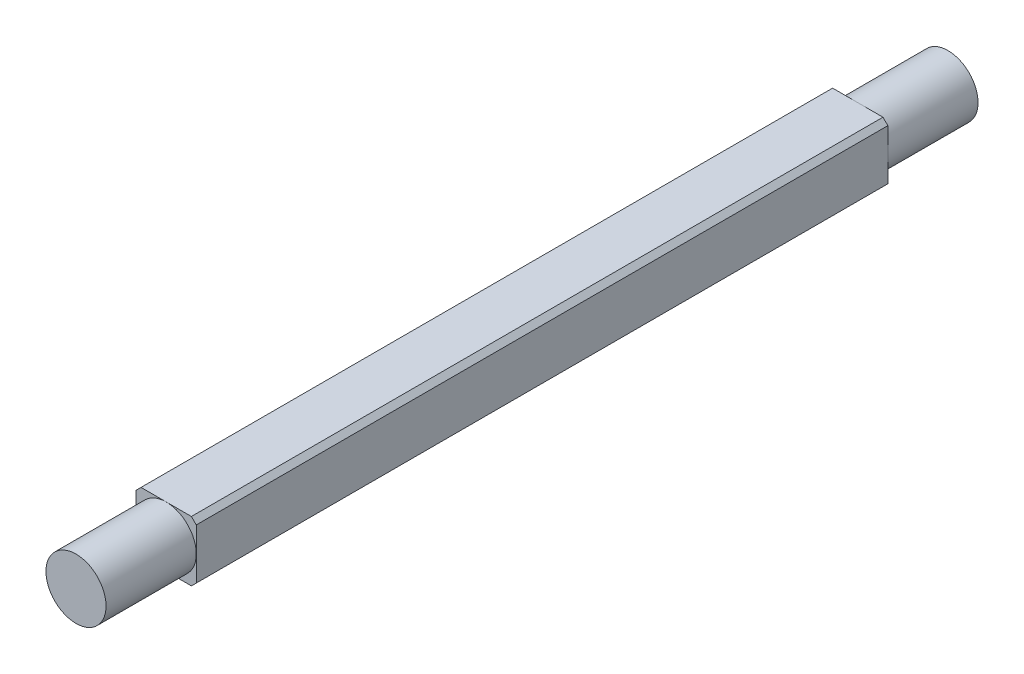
ISO-10303-21;
HEADER;
FILE_DESCRIPTION(('STEP AP214'),'2;1');
FILE_NAME('part.step','',(''),(''),'','','');
FILE_SCHEMA(('AUTOMOTIVE_DESIGN { 1 0 10303 214 1 1 1 1 }'));
ENDSEC;
DATA;
#1=APPLICATION_CONTEXT('core data for automotive mechanical design processes');
#2=APPLICATION_PROTOCOL_DEFINITION('international standard','automotive_design',2000,#1);
#3=PRODUCT_CONTEXT('',#1,'mechanical');
#4=PRODUCT('Part','Part','',(#3));
#5=PRODUCT_RELATED_PRODUCT_CATEGORY('part','',(#4));
#6=PRODUCT_DEFINITION_FORMATION('','',#4);
#7=PRODUCT_DEFINITION_CONTEXT('part definition',#1,'design');
#8=PRODUCT_DEFINITION('design','',#6,#7);
#9=PRODUCT_DEFINITION_SHAPE('','',#8);
#10=(LENGTH_UNIT() NAMED_UNIT(*) SI_UNIT(.MILLI.,.METRE.));
#11=(NAMED_UNIT(*) PLANE_ANGLE_UNIT() SI_UNIT($,.RADIAN.));
#12=(NAMED_UNIT(*) SI_UNIT($,.STERADIAN.) SOLID_ANGLE_UNIT());
#13=UNCERTAINTY_MEASURE_WITH_UNIT(LENGTH_MEASURE(1.E-05),#10,'distance_accuracy_value','');
#14=(GEOMETRIC_REPRESENTATION_CONTEXT(3) GLOBAL_UNCERTAINTY_ASSIGNED_CONTEXT((#13)) GLOBAL_UNIT_ASSIGNED_CONTEXT((#10,
#11,#12)) REPRESENTATION_CONTEXT('',''));
#15=CARTESIAN_POINT('',(0.,0.,0.));
#16=DIRECTION('',(0.,0.,1.));
#17=DIRECTION('',(1.,0.,0.));
#18=AXIS2_PLACEMENT_3D('',#15,#16,#17);
#19=CARTESIAN_POINT('',(0.,0.,0.));
#20=DIRECTION('',(0.,0.,1.));
#21=DIRECTION('',(1.,0.,0.));
#22=AXIS2_PLACEMENT_3D('',#19,#20,#21);
#23=PLANE('',#22);
#24=CARTESIAN_POINT('',(0.,0.,0.));
#25=DIRECTION('',(0.,0.,-1.));
#26=DIRECTION('',(-1.,0.,0.));
#27=AXIS2_PLACEMENT_3D('',#24,#25,#26);
#28=CIRCLE('',#27,4.);
#29=CARTESIAN_POINT('',(-4.,0.,0.));
#30=VERTEX_POINT('',#29);
#31=CARTESIAN_POINT('',(0.,4.,0.));
#32=VERTEX_POINT('',#31);
#33=EDGE_CURVE('E54',#30,#32,#28,.T.);
#34=ORIENTED_EDGE('',*,*,#33,.F.);
#35=DIRECTION('',(0.,-1.,0.));
#36=VECTOR('',#35,1.);
#37=CARTESIAN_POINT('',(-4.,4.,0.));
#38=LINE('',#37,#36);
#39=CARTESIAN_POINT('',(-4.,3.34999999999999,0.));
#40=VERTEX_POINT('',#39);
#41=EDGE_CURVE('E125',#40,#30,#38,.T.);
#42=ORIENTED_EDGE('',*,*,#41,.F.);
#43=DIRECTION('',(-0.707106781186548,-0.707106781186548,0.));
#44=VECTOR('',#43,1.);
#45=CARTESIAN_POINT('',(-4.,3.34999999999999,0.));
#46=LINE('',#45,#44);
#47=CARTESIAN_POINT('',(-3.34999999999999,4.,0.));
#48=VERTEX_POINT('',#47);
#49=EDGE_CURVE('E197',#40,#48,#46,.F.);
#50=ORIENTED_EDGE('',*,*,#49,.T.);
#51=DIRECTION('',(-1.,0.,0.));
#52=VECTOR('',#51,1.);
#53=CARTESIAN_POINT('',(-4.,4.,0.));
#54=LINE('',#53,#52);
#55=EDGE_CURVE('E145',#32,#48,#54,.T.);
#56=ORIENTED_EDGE('',*,*,#55,.F.);
#57=EDGE_LOOP('',(#34,#42,#50,#56));
#58=FACE_BOUND('',#57,.T.);
#59=ADVANCED_FACE('F41',(#58),#23,.F.);
#60=CARTESIAN_POINT('',(4.,0.,0.));
#61=VERTEX_POINT('',#60);
#62=EDGE_CURVE('E11',#32,#61,#28,.T.);
#63=ORIENTED_EDGE('',*,*,#62,.F.);
#64=CARTESIAN_POINT('',(3.35,4.,0.));
#65=VERTEX_POINT('',#64);
#66=EDGE_CURVE('E142',#65,#32,#54,.T.);
#67=ORIENTED_EDGE('',*,*,#66,.F.);
#68=DIRECTION('',(-0.707106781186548,0.707106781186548,0.));
#69=VECTOR('',#68,1.);
#70=CARTESIAN_POINT('',(3.35,4.,0.));
#71=LINE('',#70,#69);
#72=CARTESIAN_POINT('',(4.,3.35,0.));
#73=VERTEX_POINT('',#72);
#74=EDGE_CURVE('E206',#65,#73,#71,.F.);
#75=ORIENTED_EDGE('',*,*,#74,.T.);
#76=DIRECTION('',(0.,1.,0.));
#77=VECTOR('',#76,1.);
#78=CARTESIAN_POINT('',(4.,4.,0.));
#79=LINE('',#78,#77);
#80=EDGE_CURVE('E162',#61,#73,#79,.T.);
#81=ORIENTED_EDGE('',*,*,#80,.F.);
#82=EDGE_LOOP('',(#63,#67,#75,#81));
#83=FACE_BOUND('',#82,.T.);
#84=ADVANCED_FACE('F277',(#83),#23,.F.);
#85=CARTESIAN_POINT('',(0.,-4.,0.));
#86=VERTEX_POINT('',#85);
#87=EDGE_CURVE('E52',#61,#86,#28,.T.);
#88=ORIENTED_EDGE('',*,*,#87,.F.);
#89=CARTESIAN_POINT('',(4.,-3.35,0.));
#90=VERTEX_POINT('',#89);
#91=EDGE_CURVE('E182',#90,#61,#79,.T.);
#92=ORIENTED_EDGE('',*,*,#91,.F.);
#93=DIRECTION('',(0.707106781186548,0.707106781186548,0.));
#94=VECTOR('',#93,1.);
#95=CARTESIAN_POINT('',(4.,-3.35,0.));
#96=LINE('',#95,#94);
#97=CARTESIAN_POINT('',(3.35,-4.,0.));
#98=VERTEX_POINT('',#97);
#99=EDGE_CURVE('E202',#90,#98,#96,.F.);
#100=ORIENTED_EDGE('',*,*,#99,.T.);
#101=DIRECTION('',(1.,0.,0.));
#102=VECTOR('',#101,1.);
#103=CARTESIAN_POINT('',(-4.,-4.,0.));
#104=LINE('',#103,#102);
#105=EDGE_CURVE('E136',#86,#98,#104,.T.);
#106=ORIENTED_EDGE('',*,*,#105,.F.);
#107=EDGE_LOOP('',(#88,#92,#100,#106));
#108=FACE_BOUND('',#107,.T.);
#109=ADVANCED_FACE('F255',(#108),#23,.F.);
#110=CARTESIAN_POINT('',(4.,4.,92.));
#111=DIRECTION('',(-1.,0.,0.));
#112=DIRECTION('',(0.,-1.,0.));
#113=AXIS2_PLACEMENT_3D('',#110,#111,#112);
#114=PLANE('',#113);
#115=ORIENTED_EDGE('',*,*,#91,.T.);
#116=ORIENTED_EDGE('',*,*,#80,.T.);
#117=DIRECTION('',(0.,0.,1.));
#118=VECTOR('',#117,1.);
#119=CARTESIAN_POINT('',(4.,3.35,92.));
#120=LINE('',#119,#118);
#121=CARTESIAN_POINT('',(4.,3.35,92.));
#122=VERTEX_POINT('',#121);
#123=EDGE_CURVE('E214',#73,#122,#120,.T.);
#124=ORIENTED_EDGE('',*,*,#123,.T.);
#125=DIRECTION('',(0.,1.,0.));
#126=VECTOR('',#125,1.);
#127=CARTESIAN_POINT('',(4.,4.,92.));
#128=LINE('',#127,#126);
#129=CARTESIAN_POINT('',(4.,-3.35,92.));
#130=VERTEX_POINT('',#129);
#131=EDGE_CURVE('E164',#130,#122,#128,.T.);
#132=ORIENTED_EDGE('',*,*,#131,.F.);
#133=DIRECTION('',(0.,0.,-1.));
#134=VECTOR('',#133,1.);
#135=CARTESIAN_POINT('',(4.,-3.35,92.));
#136=LINE('',#135,#134);
#137=EDGE_CURVE('E210',#130,#90,#136,.T.);
#138=ORIENTED_EDGE('',*,*,#137,.T.);
#139=EDGE_LOOP('',(#115,#116,#124,#132,#138));
#140=FACE_BOUND('',#139,.T.);
#141=ADVANCED_FACE('F254',(#140),#114,.F.);
#142=CARTESIAN_POINT('',(-4.,4.,92.));
#143=DIRECTION('',(0.,-1.,0.));
#144=DIRECTION('',(0.,0.,-1.));
#145=AXIS2_PLACEMENT_3D('',#142,#143,#144);
#146=PLANE('',#145);
#147=DIRECTION('',(-1.,0.,0.));
#148=VECTOR('',#147,1.);
#149=CARTESIAN_POINT('',(-4.,4.,92.));
#150=LINE('',#149,#148);
#151=CARTESIAN_POINT('',(3.35,4.,92.));
#152=VERTEX_POINT('',#151);
#153=CARTESIAN_POINT('',(-3.34999999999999,4.,92.));
#154=VERTEX_POINT('',#153);
#155=EDGE_CURVE('E168',#152,#154,#150,.T.);
#156=ORIENTED_EDGE('',*,*,#155,.F.);
#157=DIRECTION('',(0.,0.,-1.));
#158=VECTOR('',#157,1.);
#159=CARTESIAN_POINT('',(3.35,4.,92.));
#160=LINE('',#159,#158);
#161=EDGE_CURVE('E193',#152,#65,#160,.T.);
#162=ORIENTED_EDGE('',*,*,#161,.T.);
#163=ORIENTED_EDGE('',*,*,#66,.T.);
#164=ORIENTED_EDGE('',*,*,#55,.T.);
#165=DIRECTION('',(0.,0.,1.));
#166=VECTOR('',#165,1.);
#167=CARTESIAN_POINT('',(-3.34999999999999,4.,92.));
#168=LINE('',#167,#166);
#169=EDGE_CURVE('E181',#48,#154,#168,.T.);
#170=ORIENTED_EDGE('',*,*,#169,.T.);
#171=EDGE_LOOP('',(#156,#162,#163,#164,#170));
#172=FACE_BOUND('',#171,.T.);
#173=ADVANCED_FACE('F298',(#172),#146,.F.);
#174=CARTESIAN_POINT('',(-4.,4.,92.));
#175=DIRECTION('',(1.,0.,0.));
#176=DIRECTION('',(0.,1.,0.));
#177=AXIS2_PLACEMENT_3D('',#174,#175,#176);
#178=PLANE('',#177);
#179=ORIENTED_EDGE('',*,*,#41,.T.);
#180=CARTESIAN_POINT('',(-4.,-3.35,0.));
#181=VERTEX_POINT('',#180);
#182=EDGE_CURVE('E127',#30,#181,#38,.T.);
#183=ORIENTED_EDGE('',*,*,#182,.T.);
#184=DIRECTION('',(0.,0.,1.));
#185=VECTOR('',#184,1.);
#186=CARTESIAN_POINT('',(-4.,-3.35,92.));
#187=LINE('',#186,#185);
#188=CARTESIAN_POINT('',(-4.,-3.35,92.));
#189=VERTEX_POINT('',#188);
#190=EDGE_CURVE('E46',#181,#189,#187,.T.);
#191=ORIENTED_EDGE('',*,*,#190,.T.);
#192=DIRECTION('',(0.,-1.,0.));
#193=VECTOR('',#192,1.);
#194=CARTESIAN_POINT('',(-4.,4.,92.));
#195=LINE('',#194,#193);
#196=CARTESIAN_POINT('',(-4.,3.34999999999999,92.));
#197=VERTEX_POINT('',#196);
#198=EDGE_CURVE('E173',#197,#189,#195,.T.);
#199=ORIENTED_EDGE('',*,*,#198,.F.);
#200=DIRECTION('',(0.,0.,-1.));
#201=VECTOR('',#200,1.);
#202=CARTESIAN_POINT('',(-4.,3.34999999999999,92.));
#203=LINE('',#202,#201);
#204=EDGE_CURVE('E131',#197,#40,#203,.T.);
#205=ORIENTED_EDGE('',*,*,#204,.T.);
#206=EDGE_LOOP('',(#179,#183,#191,#199,#205));
#207=FACE_BOUND('',#206,.T.);
#208=ADVANCED_FACE('F126',(#207),#178,.F.);
#209=CARTESIAN_POINT('',(-4.,-4.,92.));
#210=DIRECTION('',(0.,1.,0.));
#211=DIRECTION('',(0.,0.,1.));
#212=AXIS2_PLACEMENT_3D('',#209,#210,#211);
#213=PLANE('',#212);
#214=CARTESIAN_POINT('',(-3.35,-4.,0.));
#215=VERTEX_POINT('',#214);
#216=EDGE_CURVE('E169',#215,#86,#104,.T.);
#217=ORIENTED_EDGE('',*,*,#216,.T.);
#218=ORIENTED_EDGE('',*,*,#105,.T.);
#219=DIRECTION('',(0.,0.,1.));
#220=VECTOR('',#219,1.);
#221=CARTESIAN_POINT('',(3.35,-4.,92.));
#222=LINE('',#221,#220);
#223=CARTESIAN_POINT('',(3.35,-4.,92.));
#224=VERTEX_POINT('',#223);
#225=EDGE_CURVE('E233',#98,#224,#222,.T.);
#226=ORIENTED_EDGE('',*,*,#225,.T.);
#227=DIRECTION('',(1.,0.,0.));
#228=VECTOR('',#227,1.);
#229=CARTESIAN_POINT('',(-4.,-4.,92.));
#230=LINE('',#229,#228);
#231=CARTESIAN_POINT('',(-3.35,-4.,92.));
#232=VERTEX_POINT('',#231);
#233=EDGE_CURVE('E177',#232,#224,#230,.T.);
#234=ORIENTED_EDGE('',*,*,#233,.F.);
#235=DIRECTION('',(0.,0.,-1.));
#236=VECTOR('',#235,1.);
#237=CARTESIAN_POINT('',(-3.35,-4.,92.));
#238=LINE('',#237,#236);
#239=EDGE_CURVE('E229',#232,#215,#238,.T.);
#240=ORIENTED_EDGE('',*,*,#239,.T.);
#241=EDGE_LOOP('',(#217,#218,#226,#234,#240));
#242=FACE_BOUND('',#241,.T.);
#243=ADVANCED_FACE('F246',(#242),#213,.F.);
#244=CARTESIAN_POINT('',(0.,0.,92.));
#245=DIRECTION('',(0.,0.,1.));
#246=DIRECTION('',(1.,0.,0.));
#247=AXIS2_PLACEMENT_3D('',#244,#245,#246);
#248=PLANE('',#247);
#249=CARTESIAN_POINT('',(0.,0.,92.));
#250=DIRECTION('',(0.,0.,1.));
#251=DIRECTION('',(1.,0.,0.));
#252=AXIS2_PLACEMENT_3D('',#249,#250,#251);
#253=CIRCLE('',#252,3.99820557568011);
#254=CARTESIAN_POINT('',(3.99820557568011,0.,92.));
#255=VERTEX_POINT('',#254);
#256=EDGE_CURVE('E152',#255,#255,#253,.T.);
#257=ORIENTED_EDGE('',*,*,#256,.F.);
#258=EDGE_LOOP('',(#257));
#259=FACE_BOUND('',#258,.T.);
#260=ORIENTED_EDGE('',*,*,#131,.T.);
#261=DIRECTION('',(0.707106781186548,-0.707106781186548,0.));
#262=VECTOR('',#261,1.);
#263=CARTESIAN_POINT('',(3.675,3.675,92.));
#264=LINE('',#263,#262);
#265=EDGE_CURVE('E226',#122,#152,#264,.F.);
#266=ORIENTED_EDGE('',*,*,#265,.T.);
#267=ORIENTED_EDGE('',*,*,#155,.T.);
#268=DIRECTION('',(0.707106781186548,0.707106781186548,0.));
#269=VECTOR('',#268,1.);
#270=CARTESIAN_POINT('',(-3.67499999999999,3.67499999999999,92.));
#271=LINE('',#270,#269);
#272=EDGE_CURVE('E217',#154,#197,#271,.F.);
#273=ORIENTED_EDGE('',*,*,#272,.T.);
#274=ORIENTED_EDGE('',*,*,#198,.T.);
#275=DIRECTION('',(-0.707106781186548,0.707106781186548,0.));
#276=VECTOR('',#275,1.);
#277=CARTESIAN_POINT('',(-3.675,-3.675,92.));
#278=LINE('',#277,#276);
#279=EDGE_CURVE('E220',#189,#232,#278,.F.);
#280=ORIENTED_EDGE('',*,*,#279,.T.);
#281=ORIENTED_EDGE('',*,*,#233,.T.);
#282=DIRECTION('',(-0.707106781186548,-0.707106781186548,0.));
#283=VECTOR('',#282,1.);
#284=CARTESIAN_POINT('',(3.675,-3.675,92.));
#285=LINE('',#284,#283);
#286=EDGE_CURVE('E223',#224,#130,#285,.F.);
#287=ORIENTED_EDGE('',*,*,#286,.T.);
#288=EDGE_LOOP('',(#260,#266,#267,#273,#274,#280,#281,#287));
#289=FACE_BOUND('',#288,.T.);
#290=ADVANCED_FACE('F240',(#259,#289),#248,.T.);
#291=EDGE_CURVE('E61',#86,#30,#28,.T.);
#292=ORIENTED_EDGE('',*,*,#291,.F.);
#293=ORIENTED_EDGE('',*,*,#216,.F.);
#294=DIRECTION('',(0.707106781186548,-0.707106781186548,0.));
#295=VECTOR('',#294,1.);
#296=CARTESIAN_POINT('',(-3.35,-4.,0.));
#297=LINE('',#296,#295);
#298=EDGE_CURVE('E139',#215,#181,#297,.F.);
#299=ORIENTED_EDGE('',*,*,#298,.T.);
#300=ORIENTED_EDGE('',*,*,#182,.F.);
#301=EDGE_LOOP('',(#292,#293,#299,#300));
#302=FACE_BOUND('',#301,.T.);
#303=ADVANCED_FACE('F138',(#302),#23,.F.);
#304=CARTESIAN_POINT('',(3.35,4.,92.));
#305=DIRECTION('',(-0.707106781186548,-0.707106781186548,0.));
#306=DIRECTION('',(0.,0.,-1.));
#307=AXIS2_PLACEMENT_3D('',#304,#305,#306);
#308=PLANE('',#307);
#309=ORIENTED_EDGE('',*,*,#265,.F.);
#310=ORIENTED_EDGE('',*,*,#123,.F.);
#311=ORIENTED_EDGE('',*,*,#74,.F.);
#312=ORIENTED_EDGE('',*,*,#161,.F.);
#313=EDGE_LOOP('',(#309,#310,#311,#312));
#314=FACE_BOUND('',#313,.T.);
#315=ADVANCED_FACE('F286',(#314),#308,.F.);
#316=CARTESIAN_POINT('',(4.,-3.35,92.));
#317=DIRECTION('',(-0.707106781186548,0.707106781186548,0.));
#318=DIRECTION('',(0.,0.,-1.));
#319=AXIS2_PLACEMENT_3D('',#316,#317,#318);
#320=PLANE('',#319);
#321=ORIENTED_EDGE('',*,*,#286,.F.);
#322=ORIENTED_EDGE('',*,*,#225,.F.);
#323=ORIENTED_EDGE('',*,*,#99,.F.);
#324=ORIENTED_EDGE('',*,*,#137,.F.);
#325=EDGE_LOOP('',(#321,#322,#323,#324));
#326=FACE_BOUND('',#325,.T.);
#327=ADVANCED_FACE('F252',(#326),#320,.F.);
#328=CARTESIAN_POINT('',(-3.35,-4.,92.));
#329=DIRECTION('',(0.707106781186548,0.707106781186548,0.));
#330=DIRECTION('',(0.,0.,-1.));
#331=AXIS2_PLACEMENT_3D('',#328,#329,#330);
#332=PLANE('',#331);
#333=ORIENTED_EDGE('',*,*,#279,.F.);
#334=ORIENTED_EDGE('',*,*,#190,.F.);
#335=ORIENTED_EDGE('',*,*,#298,.F.);
#336=ORIENTED_EDGE('',*,*,#239,.F.);
#337=EDGE_LOOP('',(#333,#334,#335,#336));
#338=FACE_BOUND('',#337,.T.);
#339=ADVANCED_FACE('F244',(#338),#332,.F.);
#340=CARTESIAN_POINT('',(-4.,3.34999999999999,92.));
#341=DIRECTION('',(0.707106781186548,-0.707106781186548,0.));
#342=DIRECTION('',(0.,0.,-1.));
#343=AXIS2_PLACEMENT_3D('',#340,#341,#342);
#344=PLANE('',#343);
#345=ORIENTED_EDGE('',*,*,#272,.F.);
#346=ORIENTED_EDGE('',*,*,#169,.F.);
#347=ORIENTED_EDGE('',*,*,#49,.F.);
#348=ORIENTED_EDGE('',*,*,#204,.F.);
#349=EDGE_LOOP('',(#345,#346,#347,#348));
#350=FACE_BOUND('',#349,.T.);
#351=ADVANCED_FACE('F44',(#350),#344,.F.);
#352=CARTESIAN_POINT('',(0.,0.,104.));
#353=DIRECTION('',(0.,0.,-1.));
#354=DIRECTION('',(-1.,0.,0.));
#355=AXIS2_PLACEMENT_3D('',#352,#353,#354);
#356=CYLINDRICAL_SURFACE('',#355,3.99820557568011);
#357=CARTESIAN_POINT('',(0.,0.,104.));
#358=DIRECTION('',(0.,0.,1.));
#359=DIRECTION('',(1.,0.,0.));
#360=AXIS2_PLACEMENT_3D('',#357,#358,#359);
#361=CIRCLE('',#360,3.99820557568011);
#362=CARTESIAN_POINT('',(3.99820557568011,0.,104.));
#363=VERTEX_POINT('',#362);
#364=EDGE_CURVE('E159',#363,#363,#361,.T.);
#365=ORIENTED_EDGE('',*,*,#364,.F.);
#366=EDGE_LOOP('',(#365));
#367=FACE_BOUND('',#366,.T.);
#368=ORIENTED_EDGE('',*,*,#256,.T.);
#369=EDGE_LOOP('',(#368));
#370=FACE_BOUND('',#369,.T.);
#371=ADVANCED_FACE('F273',(#367,#370),#356,.T.);
#372=CARTESIAN_POINT('',(0.,0.,104.));
#373=DIRECTION('',(0.,0.,1.));
#374=DIRECTION('',(1.,0.,0.));
#375=AXIS2_PLACEMENT_3D('',#372,#373,#374);
#376=PLANE('',#375);
#377=ORIENTED_EDGE('',*,*,#364,.T.);
#378=EDGE_LOOP('',(#377));
#379=FACE_BOUND('',#378,.T.);
#380=ADVANCED_FACE('F266',(#379),#376,.T.);
#381=CARTESIAN_POINT('',(0.,0.,-12.));
#382=DIRECTION('',(0.,0.,1.));
#383=DIRECTION('',(1.,0.,0.));
#384=AXIS2_PLACEMENT_3D('',#381,#382,#383);
#385=CYLINDRICAL_SURFACE('',#384,4.);
#386=CARTESIAN_POINT('',(0.,0.,-12.));
#387=DIRECTION('',(0.,0.,-1.));
#388=DIRECTION('',(-1.,0.,0.));
#389=AXIS2_PLACEMENT_3D('',#386,#387,#388);
#390=CIRCLE('',#389,4.);
#391=CARTESIAN_POINT('',(-4.,0.,-12.));
#392=VERTEX_POINT('',#391);
#393=EDGE_CURVE('E149',#392,#392,#390,.T.);
#394=ORIENTED_EDGE('',*,*,#393,.F.);
#395=EDGE_LOOP('',(#394));
#396=FACE_BOUND('',#395,.T.);
#397=ORIENTED_EDGE('',*,*,#33,.T.);
#398=ORIENTED_EDGE('',*,*,#62,.T.);
#399=ORIENTED_EDGE('',*,*,#87,.T.);
#400=ORIENTED_EDGE('',*,*,#291,.T.);
#401=EDGE_LOOP('',(#397,#398,#399,#400));
#402=FACE_BOUND('',#401,.T.);
#403=ADVANCED_FACE('F150',(#396,#402),#385,.T.);
#404=CARTESIAN_POINT('',(0.,0.,-12.));
#405=DIRECTION('',(0.,0.,-1.));
#406=DIRECTION('',(-1.,0.,0.));
#407=AXIS2_PLACEMENT_3D('',#404,#405,#406);
#408=PLANE('',#407);
#409=ORIENTED_EDGE('',*,*,#393,.T.);
#410=EDGE_LOOP('',(#409));
#411=FACE_BOUND('',#410,.T.);
#412=ADVANCED_FACE('F263',(#411),#408,.T.);
#413=CLOSED_SHELL('',(#59,#84,#109,#141,#173,#208,#243,#290,#303,#315,#327,#339,#351,#371,#380,
#403,#412));
#414=MANIFOLD_SOLID_BREP('B2',#413);
#415=ADVANCED_BREP_SHAPE_REPRESENTATION('',(#18,#414),#14);
#416=SHAPE_DEFINITION_REPRESENTATION(#9,#415);
ENDSEC;
END-ISO-10303-21;
